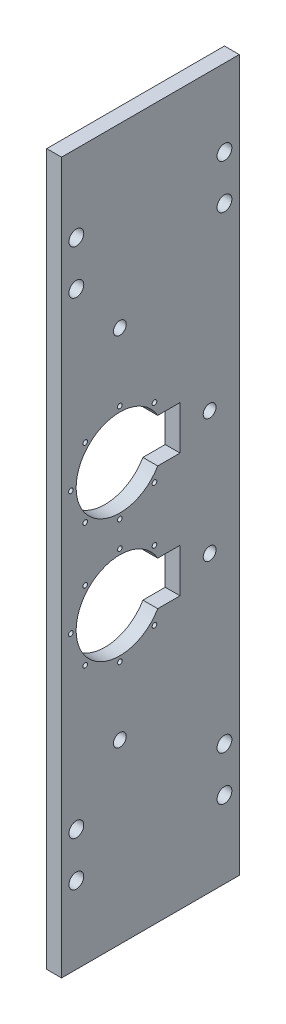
ISO-10303-21;
HEADER;
FILE_DESCRIPTION(('STEP AP214'),'2;1');
FILE_NAME('part.step','',(''),(''),'','','');
FILE_SCHEMA(('AUTOMOTIVE_DESIGN { 1 0 10303 214 1 1 1 1 }'));
ENDSEC;
DATA;
#1=APPLICATION_CONTEXT('core data for automotive mechanical design processes');
#2=APPLICATION_PROTOCOL_DEFINITION('international standard','automotive_design',2000,#1);
#3=PRODUCT_CONTEXT('',#1,'mechanical');
#4=PRODUCT('Part','Part','',(#3));
#5=PRODUCT_RELATED_PRODUCT_CATEGORY('part','',(#4));
#6=PRODUCT_DEFINITION_FORMATION('','',#4);
#7=PRODUCT_DEFINITION_CONTEXT('part definition',#1,'design');
#8=PRODUCT_DEFINITION('design','',#6,#7);
#9=PRODUCT_DEFINITION_SHAPE('','',#8);
#10=(LENGTH_UNIT() NAMED_UNIT(*) SI_UNIT(.MILLI.,.METRE.));
#11=(NAMED_UNIT(*) PLANE_ANGLE_UNIT() SI_UNIT($,.RADIAN.));
#12=(NAMED_UNIT(*) SI_UNIT($,.STERADIAN.) SOLID_ANGLE_UNIT());
#13=UNCERTAINTY_MEASURE_WITH_UNIT(LENGTH_MEASURE(1.E-05),#10,'distance_accuracy_value','');
#14=(GEOMETRIC_REPRESENTATION_CONTEXT(3) GLOBAL_UNCERTAINTY_ASSIGNED_CONTEXT((#13)) GLOBAL_UNIT_ASSIGNED_CONTEXT((#10,
#11,#12)) REPRESENTATION_CONTEXT('',''));
#15=CARTESIAN_POINT('',(0.,0.,0.));
#16=DIRECTION('',(0.,0.,1.));
#17=DIRECTION('',(1.,0.,0.));
#18=AXIS2_PLACEMENT_3D('',#15,#16,#17);
#19=CARTESIAN_POINT('',(6.35,0.,0.));
#20=DIRECTION('',(1.,0.,0.));
#21=DIRECTION('',(0.,0.,-1.));
#22=AXIS2_PLACEMENT_3D('',#19,#20,#21);
#23=PLANE('',#22);
#24=CARTESIAN_POINT('',(6.35,53.,-50.8));
#25=DIRECTION('',(1.,0.,0.));
#26=DIRECTION('',(0.,0.,-1.));
#27=AXIS2_PLACEMENT_3D('',#24,#25,#26);
#28=CIRCLE('',#27,5.49999999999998);
#29=CARTESIAN_POINT('',(6.35,53.,-56.3));
#30=VERTEX_POINT('',#29);
#31=EDGE_CURVE('E805',#30,#30,#28,.T.);
#32=ORIENTED_EDGE('',*,*,#31,.F.);
#33=EDGE_LOOP('',(#32));
#34=FACE_BOUND('',#33,.T.);
#35=CARTESIAN_POINT('',(6.35,153.,26.2));
#36=DIRECTION('',(1.,0.,0.));
#37=DIRECTION('',(0.,0.,-1.));
#38=AXIS2_PLACEMENT_3D('',#35,#36,#37);
#39=CIRCLE('',#38,5.49999999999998);
#40=CARTESIAN_POINT('',(6.35,153.,20.7));
#41=VERTEX_POINT('',#40);
#42=EDGE_CURVE('E807',#41,#41,#39,.T.);
#43=ORIENTED_EDGE('',*,*,#42,.F.);
#44=EDGE_LOOP('',(#43));
#45=FACE_BOUND('',#44,.T.);
#46=CARTESIAN_POINT('',(6.35,-53.,-50.8));
#47=DIRECTION('',(1.,0.,0.));
#48=DIRECTION('',(0.,0.,-1.));
#49=AXIS2_PLACEMENT_3D('',#46,#47,#48);
#50=CIRCLE('',#49,5.49999999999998);
#51=CARTESIAN_POINT('',(6.35,-53.,-56.3));
#52=VERTEX_POINT('',#51);
#53=EDGE_CURVE('E815',#52,#52,#50,.T.);
#54=ORIENTED_EDGE('',*,*,#53,.F.);
#55=EDGE_LOOP('',(#54));
#56=FACE_BOUND('',#55,.T.);
#57=CARTESIAN_POINT('',(6.35,-153.,26.2));
#58=DIRECTION('',(1.,0.,0.));
#59=DIRECTION('',(0.,0.,-1.));
#60=AXIS2_PLACEMENT_3D('',#57,#58,#59);
#61=CIRCLE('',#60,5.49999999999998);
#62=CARTESIAN_POINT('',(6.35,-153.,20.7));
#63=VERTEX_POINT('',#62);
#64=EDGE_CURVE('E821',#63,#63,#61,.T.);
#65=ORIENTED_EDGE('',*,*,#64,.F.);
#66=EDGE_LOOP('',(#65));
#67=FACE_BOUND('',#66,.T.);
#68=CARTESIAN_POINT('',(6.35,-11.0000000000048,26.1999999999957));
#69=DIRECTION('',(1.,0.,0.));
#70=DIRECTION('',(0.,0.,1.));
#71=AXIS2_PLACEMENT_3D('',#68,#69,#70);
#72=CIRCLE('',#71,2.00000000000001);
#73=CARTESIAN_POINT('',(6.35,-11.0000000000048,28.1999999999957));
#74=VERTEX_POINT('',#73);
#75=EDGE_CURVE('E174',#74,#74,#72,.T.);
#76=ORIENTED_EDGE('',*,*,#75,.F.);
#77=EDGE_LOOP('',(#76));
#78=FACE_BOUND('',#77,.T.);
#79=CARTESIAN_POINT('',(6.35,-53.,68.2));
#80=DIRECTION('',(1.,0.,0.));
#81=DIRECTION('',(0.,0.,1.));
#82=AXIS2_PLACEMENT_3D('',#79,#80,#81);
#83=CIRCLE('',#82,2.);
#84=CARTESIAN_POINT('',(6.35,-53.,70.2));
#85=VERTEX_POINT('',#84);
#86=EDGE_CURVE('E186',#85,#85,#83,.T.);
#87=ORIENTED_EDGE('',*,*,#86,.F.);
#88=EDGE_LOOP('',(#87));
#89=FACE_BOUND('',#88,.T.);
#90=CARTESIAN_POINT('',(6.35,-95.0000000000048,26.2000000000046));
#91=DIRECTION('',(1.,0.,0.));
#92=DIRECTION('',(0.,0.,1.));
#93=AXIS2_PLACEMENT_3D('',#90,#91,#92);
#94=CIRCLE('',#93,2.00000000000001);
#95=CARTESIAN_POINT('',(6.35,-95.0000000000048,28.2000000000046));
#96=VERTEX_POINT('',#95);
#97=EDGE_CURVE('E198',#96,#96,#94,.T.);
#98=ORIENTED_EDGE('',*,*,#97,.F.);
#99=EDGE_LOOP('',(#98));
#100=FACE_BOUND('',#99,.T.);
#101=CARTESIAN_POINT('',(6.35,-200.66,-63.5));
#102=DIRECTION('',(1.,0.,0.));
#103=DIRECTION('',(0.,0.,-1.));
#104=AXIS2_PLACEMENT_3D('',#101,#102,#103);
#105=CIRCLE('',#104,6.34999999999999);
#106=CARTESIAN_POINT('',(6.35,-200.66,-69.85));
#107=VERTEX_POINT('',#106);
#108=EDGE_CURVE('E210',#107,#107,#105,.T.);
#109=ORIENTED_EDGE('',*,*,#108,.F.);
#110=EDGE_LOOP('',(#109));
#111=FACE_BOUND('',#110,.T.);
#112=CARTESIAN_POINT('',(6.35,-238.76,63.5));
#113=DIRECTION('',(1.,0.,0.));
#114=DIRECTION('',(0.,0.,1.));
#115=AXIS2_PLACEMENT_3D('',#112,#113,#114);
#116=CIRCLE('',#115,6.34999999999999);
#117=CARTESIAN_POINT('',(6.35,-238.76,69.85));
#118=VERTEX_POINT('',#117);
#119=EDGE_CURVE('E222',#118,#118,#116,.T.);
#120=ORIENTED_EDGE('',*,*,#119,.F.);
#121=EDGE_LOOP('',(#120));
#122=FACE_BOUND('',#121,.T.);
#123=CARTESIAN_POINT('',(6.35,238.76,-63.5));
#124=DIRECTION('',(1.,0.,0.));
#125=DIRECTION('',(0.,0.,1.));
#126=AXIS2_PLACEMENT_3D('',#123,#124,#125);
#127=CIRCLE('',#126,6.34999999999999);
#128=CARTESIAN_POINT('',(6.35,238.76,-57.15));
#129=VERTEX_POINT('',#128);
#130=EDGE_CURVE('E234',#129,#129,#127,.T.);
#131=ORIENTED_EDGE('',*,*,#130,.F.);
#132=EDGE_LOOP('',(#131));
#133=FACE_BOUND('',#132,.T.);
#134=CARTESIAN_POINT('',(6.35,200.66,63.5));
#135=DIRECTION('',(1.,0.,0.));
#136=DIRECTION('',(0.,0.,-1.));
#137=AXIS2_PLACEMENT_3D('',#134,#135,#136);
#138=CIRCLE('',#137,6.34999999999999);
#139=CARTESIAN_POINT('',(6.35,200.66,57.15));
#140=VERTEX_POINT('',#139);
#141=EDGE_CURVE('E246',#140,#140,#138,.T.);
#142=ORIENTED_EDGE('',*,*,#141,.F.);
#143=EDGE_LOOP('',(#142));
#144=FACE_BOUND('',#143,.T.);
#145=CARTESIAN_POINT('',(6.35,11.0000000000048,26.1999999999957));
#146=DIRECTION('',(1.,0.,0.));
#147=DIRECTION('',(0.,0.,-1.));
#148=AXIS2_PLACEMENT_3D('',#145,#146,#147);
#149=CIRCLE('',#148,2.00000000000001);
#150=CARTESIAN_POINT('',(6.35,11.0000000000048,24.1999999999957));
#151=VERTEX_POINT('',#150);
#152=EDGE_CURVE('E258',#151,#151,#149,.T.);
#153=ORIENTED_EDGE('',*,*,#152,.F.);
#154=EDGE_LOOP('',(#153));
#155=FACE_BOUND('',#154,.T.);
#156=CARTESIAN_POINT('',(6.35,82.698484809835,-3.498484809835));
#157=DIRECTION('',(1.,0.,0.));
#158=DIRECTION('',(0.,0.,-1.));
#159=AXIS2_PLACEMENT_3D('',#156,#157,#158);
#160=CIRCLE('',#159,1.99999999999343);
#161=CARTESIAN_POINT('',(6.35,82.698484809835,-5.49848480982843));
#162=VERTEX_POINT('',#161);
#163=EDGE_CURVE('E270',#162,#162,#160,.T.);
#164=ORIENTED_EDGE('',*,*,#163,.F.);
#165=EDGE_LOOP('',(#164));
#166=FACE_BOUND('',#165,.T.);
#167=CARTESIAN_POINT('',(6.35,82.6984848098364,55.8984848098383));
#168=DIRECTION('',(1.,0.,0.));
#169=DIRECTION('',(0.,0.,-1.));
#170=AXIS2_PLACEMENT_3D('',#167,#168,#169);
#171=CIRCLE('',#170,2.00000000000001);
#172=CARTESIAN_POINT('',(6.35,82.6984848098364,53.8984848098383));
#173=VERTEX_POINT('',#172);
#174=EDGE_CURVE('E282',#173,#173,#171,.T.);
#175=ORIENTED_EDGE('',*,*,#174,.F.);
#176=EDGE_LOOP('',(#175));
#177=FACE_BOUND('',#176,.T.);
#178=CARTESIAN_POINT('',(6.35,53.,68.2));
#179=DIRECTION('',(1.,0.,0.));
#180=DIRECTION('',(0.,0.,-1.));
#181=AXIS2_PLACEMENT_3D('',#178,#179,#180);
#182=CIRCLE('',#181,2.);
#183=CARTESIAN_POINT('',(6.35,53.,66.2));
#184=VERTEX_POINT('',#183);
#185=EDGE_CURVE('E294',#184,#184,#182,.T.);
#186=ORIENTED_EDGE('',*,*,#185,.F.);
#187=EDGE_LOOP('',(#186));
#188=FACE_BOUND('',#187,.T.);
#189=DIRECTION('',(0.,0.,1.));
#190=VECTOR('',#189,1.);
#191=CARTESIAN_POINT('',(6.35,304.8,76.2));
#192=LINE('',#191,#190);
#193=CARTESIAN_POINT('',(6.35,304.8,-76.2));
#194=VERTEX_POINT('',#193);
#195=CARTESIAN_POINT('',(6.35,304.8,76.2));
#196=VERTEX_POINT('',#195);
#197=EDGE_CURVE('E331',#194,#196,#192,.T.);
#198=ORIENTED_EDGE('',*,*,#197,.T.);
#199=DIRECTION('',(0.,-1.,0.));
#200=VECTOR('',#199,1.);
#201=CARTESIAN_POINT('',(6.35,-304.8,76.2));
#202=LINE('',#201,#200);
#203=CARTESIAN_POINT('',(6.35,-304.8,76.2));
#204=VERTEX_POINT('',#203);
#205=EDGE_CURVE('E334',#196,#204,#202,.T.);
#206=ORIENTED_EDGE('',*,*,#205,.T.);
#207=DIRECTION('',(0.,0.,-1.));
#208=VECTOR('',#207,1.);
#209=CARTESIAN_POINT('',(6.35,-304.8,76.2));
#210=LINE('',#209,#208);
#211=CARTESIAN_POINT('',(6.35,-304.8,-76.2));
#212=VERTEX_POINT('',#211);
#213=EDGE_CURVE('E337',#204,#212,#210,.T.);
#214=ORIENTED_EDGE('',*,*,#213,.T.);
#215=DIRECTION('',(0.,1.,0.));
#216=VECTOR('',#215,1.);
#217=CARTESIAN_POINT('',(6.35,-304.8,-76.2));
#218=LINE('',#217,#216);
#219=EDGE_CURVE('E339',#212,#194,#218,.T.);
#220=ORIENTED_EDGE('',*,*,#219,.T.);
#221=EDGE_LOOP('',(#198,#206,#214,#220));
#222=FACE_BOUND('',#221,.T.);
#223=DIRECTION('',(0.,0.,-1.));
#224=VECTOR('',#223,1.);
#225=CARTESIAN_POINT('',(6.35,34.25,-6.27595264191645));
#226=LINE('',#225,#224);
#227=CARTESIAN_POINT('',(6.35,34.25,-6.27595264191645));
#228=VERTEX_POINT('',#227);
#229=CARTESIAN_POINT('',(6.35,34.25,-25.4));
#230=VERTEX_POINT('',#229);
#231=EDGE_CURVE('E302',#228,#230,#226,.T.);
#232=ORIENTED_EDGE('',*,*,#231,.F.);
#233=CARTESIAN_POINT('',(6.35,53.,26.2));
#234=DIRECTION('',(1.,0.,0.));
#235=DIRECTION('',(0.,0.,-1.));
#236=AXIS2_PLACEMENT_3D('',#233,#234,#235);
#237=CIRCLE('',#236,37.5);
#238=CARTESIAN_POINT('',(6.35,71.7500000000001,-6.27595264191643));
#239=VERTEX_POINT('',#238);
#240=EDGE_CURVE('E300',#239,#228,#237,.T.);
#241=ORIENTED_EDGE('',*,*,#240,.F.);
#242=DIRECTION('',(0.,0.,1.));
#243=VECTOR('',#242,1.);
#244=CARTESIAN_POINT('',(6.35,71.7500000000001,-25.4));
#245=LINE('',#244,#243);
#246=CARTESIAN_POINT('',(6.35,71.7500000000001,-25.4));
#247=VERTEX_POINT('',#246);
#248=EDGE_CURVE('E308',#247,#239,#245,.T.);
#249=ORIENTED_EDGE('',*,*,#248,.F.);
#250=DIRECTION('',(0.,1.,0.));
#251=VECTOR('',#250,1.);
#252=CARTESIAN_POINT('',(6.35,34.25,-25.4));
#253=LINE('',#252,#251);
#254=EDGE_CURVE('E305',#230,#247,#253,.T.);
#255=ORIENTED_EDGE('',*,*,#254,.F.);
#256=EDGE_LOOP('',(#232,#241,#249,#255));
#257=FACE_BOUND('',#256,.T.);
#258=CARTESIAN_POINT('',(6.35,238.76,63.5));
#259=DIRECTION('',(1.,0.,0.));
#260=DIRECTION('',(0.,0.,-1.));
#261=AXIS2_PLACEMENT_3D('',#258,#259,#260);
#262=CIRCLE('',#261,6.34999999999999);
#263=CARTESIAN_POINT('',(6.35,238.76,57.15));
#264=VERTEX_POINT('',#263);
#265=EDGE_CURVE('E288',#264,#264,#262,.T.);
#266=ORIENTED_EDGE('',*,*,#265,.F.);
#267=EDGE_LOOP('',(#266));
#268=FACE_BOUND('',#267,.T.);
#269=CARTESIAN_POINT('',(6.35,95.0000000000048,26.2000000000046));
#270=DIRECTION('',(1.,0.,0.));
#271=DIRECTION('',(0.,0.,-1.));
#272=AXIS2_PLACEMENT_3D('',#269,#270,#271);
#273=CIRCLE('',#272,2.00000000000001);
#274=CARTESIAN_POINT('',(6.35,95.0000000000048,24.2000000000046));
#275=VERTEX_POINT('',#274);
#276=EDGE_CURVE('E276',#275,#275,#273,.T.);
#277=ORIENTED_EDGE('',*,*,#276,.F.);
#278=EDGE_LOOP('',(#277));
#279=FACE_BOUND('',#278,.T.);
#280=CARTESIAN_POINT('',(6.35,23.301515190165,-3.49848480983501));
#281=DIRECTION('',(1.,0.,0.));
#282=DIRECTION('',(0.,0.,-1.));
#283=AXIS2_PLACEMENT_3D('',#280,#281,#282);
#284=CIRCLE('',#283,1.99999999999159);
#285=CARTESIAN_POINT('',(6.35,23.301515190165,-5.4984848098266));
#286=VERTEX_POINT('',#285);
#287=EDGE_CURVE('E264',#286,#286,#284,.T.);
#288=ORIENTED_EDGE('',*,*,#287,.F.);
#289=EDGE_LOOP('',(#288));
#290=FACE_BOUND('',#289,.T.);
#291=CARTESIAN_POINT('',(6.35,23.3015151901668,55.898484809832));
#292=DIRECTION('',(1.,0.,0.));
#293=DIRECTION('',(0.,0.,-1.));
#294=AXIS2_PLACEMENT_3D('',#291,#292,#293);
#295=CIRCLE('',#294,2.00000000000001);
#296=CARTESIAN_POINT('',(6.35,23.3015151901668,53.898484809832));
#297=VERTEX_POINT('',#296);
#298=EDGE_CURVE('E252',#297,#297,#295,.T.);
#299=ORIENTED_EDGE('',*,*,#298,.F.);
#300=EDGE_LOOP('',(#299));
#301=FACE_BOUND('',#300,.T.);
#302=CARTESIAN_POINT('',(6.35,200.66,-63.5));
#303=DIRECTION('',(1.,0.,0.));
#304=DIRECTION('',(0.,0.,1.));
#305=AXIS2_PLACEMENT_3D('',#302,#303,#304);
#306=CIRCLE('',#305,6.34999999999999);
#307=CARTESIAN_POINT('',(6.35,200.66,-57.15));
#308=VERTEX_POINT('',#307);
#309=EDGE_CURVE('E240',#308,#308,#306,.T.);
#310=ORIENTED_EDGE('',*,*,#309,.F.);
#311=EDGE_LOOP('',(#310));
#312=FACE_BOUND('',#311,.T.);
#313=CARTESIAN_POINT('',(6.35,-200.66,63.5));
#314=DIRECTION('',(1.,0.,0.));
#315=DIRECTION('',(0.,0.,1.));
#316=AXIS2_PLACEMENT_3D('',#313,#314,#315);
#317=CIRCLE('',#316,6.34999999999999);
#318=CARTESIAN_POINT('',(6.35,-200.66,69.85));
#319=VERTEX_POINT('',#318);
#320=EDGE_CURVE('E228',#319,#319,#317,.T.);
#321=ORIENTED_EDGE('',*,*,#320,.F.);
#322=EDGE_LOOP('',(#321));
#323=FACE_BOUND('',#322,.T.);
#324=CARTESIAN_POINT('',(6.35,-238.76,-63.5));
#325=DIRECTION('',(1.,0.,0.));
#326=DIRECTION('',(0.,0.,-1.));
#327=AXIS2_PLACEMENT_3D('',#324,#325,#326);
#328=CIRCLE('',#327,6.34999999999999);
#329=CARTESIAN_POINT('',(6.35,-238.76,-69.85));
#330=VERTEX_POINT('',#329);
#331=EDGE_CURVE('E216',#330,#330,#328,.T.);
#332=ORIENTED_EDGE('',*,*,#331,.F.);
#333=EDGE_LOOP('',(#332));
#334=FACE_BOUND('',#333,.T.);
#335=CARTESIAN_POINT('',(6.35,-82.698484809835,-3.498484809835));
#336=DIRECTION('',(1.,0.,0.));
#337=DIRECTION('',(0.,0.,1.));
#338=AXIS2_PLACEMENT_3D('',#335,#336,#337);
#339=CIRCLE('',#338,1.99999999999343);
#340=CARTESIAN_POINT('',(6.35,-82.698484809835,-1.49848480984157));
#341=VERTEX_POINT('',#340);
#342=EDGE_CURVE('E204',#341,#341,#339,.T.);
#343=ORIENTED_EDGE('',*,*,#342,.F.);
#344=EDGE_LOOP('',(#343));
#345=FACE_BOUND('',#344,.T.);
#346=CARTESIAN_POINT('',(6.35,-82.6984848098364,55.8984848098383));
#347=DIRECTION('',(1.,0.,0.));
#348=DIRECTION('',(0.,0.,1.));
#349=AXIS2_PLACEMENT_3D('',#346,#347,#348);
#350=CIRCLE('',#349,2.00000000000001);
#351=CARTESIAN_POINT('',(6.35,-82.6984848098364,57.8984848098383));
#352=VERTEX_POINT('',#351);
#353=EDGE_CURVE('E192',#352,#352,#350,.T.);
#354=ORIENTED_EDGE('',*,*,#353,.F.);
#355=EDGE_LOOP('',(#354));
#356=FACE_BOUND('',#355,.T.);
#357=CARTESIAN_POINT('',(6.35,-23.3015151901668,55.898484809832));
#358=DIRECTION('',(1.,0.,0.));
#359=DIRECTION('',(0.,0.,1.));
#360=AXIS2_PLACEMENT_3D('',#357,#358,#359);
#361=CIRCLE('',#360,2.00000000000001);
#362=CARTESIAN_POINT('',(6.35,-23.3015151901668,57.898484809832));
#363=VERTEX_POINT('',#362);
#364=EDGE_CURVE('E180',#363,#363,#361,.T.);
#365=ORIENTED_EDGE('',*,*,#364,.F.);
#366=EDGE_LOOP('',(#365));
#367=FACE_BOUND('',#366,.T.);
#368=CARTESIAN_POINT('',(6.35,-23.301515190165,-3.49848480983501));
#369=DIRECTION('',(1.,0.,0.));
#370=DIRECTION('',(0.,0.,1.));
#371=AXIS2_PLACEMENT_3D('',#368,#369,#370);
#372=CIRCLE('',#371,1.99999999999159);
#373=CARTESIAN_POINT('',(6.35,-23.301515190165,-1.49848480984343));
#374=VERTEX_POINT('',#373);
#375=EDGE_CURVE('E168',#374,#374,#372,.T.);
#376=ORIENTED_EDGE('',*,*,#375,.F.);
#377=EDGE_LOOP('',(#376));
#378=FACE_BOUND('',#377,.T.);
#379=CARTESIAN_POINT('',(6.35,-53.,26.2));
#380=DIRECTION('',(1.,0.,0.));
#381=DIRECTION('',(0.,0.,1.));
#382=AXIS2_PLACEMENT_3D('',#379,#380,#381);
#383=CIRCLE('',#382,37.5);
#384=CARTESIAN_POINT('',(6.35,-34.25,-6.27595264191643));
#385=VERTEX_POINT('',#384);
#386=CARTESIAN_POINT('',(6.35,-71.7500000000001,-6.27595264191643));
#387=VERTEX_POINT('',#386);
#388=EDGE_CURVE('E138',#385,#387,#383,.T.);
#389=ORIENTED_EDGE('',*,*,#388,.F.);
#390=DIRECTION('',(0.,0.,1.));
#391=VECTOR('',#390,1.);
#392=CARTESIAN_POINT('',(6.35,-34.25,-6.27595264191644));
#393=LINE('',#392,#391);
#394=CARTESIAN_POINT('',(6.35,-34.25,-25.4));
#395=VERTEX_POINT('',#394);
#396=EDGE_CURVE('E130',#395,#385,#393,.T.);
#397=ORIENTED_EDGE('',*,*,#396,.F.);
#398=DIRECTION('',(0.,1.,0.));
#399=VECTOR('',#398,1.);
#400=CARTESIAN_POINT('',(6.35,-34.25,-25.4));
#401=LINE('',#400,#399);
#402=CARTESIAN_POINT('',(6.35,-71.7500000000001,-25.4));
#403=VERTEX_POINT('',#402);
#404=EDGE_CURVE('E152',#403,#395,#401,.T.);
#405=ORIENTED_EDGE('',*,*,#404,.F.);
#406=DIRECTION('',(0.,0.,-1.));
#407=VECTOR('',#406,1.);
#408=CARTESIAN_POINT('',(6.35,-71.7500000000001,-25.4));
#409=LINE('',#408,#407);
#410=EDGE_CURVE('E150',#387,#403,#409,.T.);
#411=ORIENTED_EDGE('',*,*,#410,.F.);
#412=EDGE_LOOP('',(#389,#397,#405,#411));
#413=FACE_BOUND('',#412,.T.);
#414=ADVANCED_FACE('F41',(#34,#45,#56,#67,#78,#89,#100,#111,#122,#133,#144,#155,#166,#177,#188,
#222,#257,#268,#279,#290,#301,#312,#323,#334,#345,#356,#367,#378,#413),#23,.T.);
#415=CARTESIAN_POINT('',(-6.35,0.,0.));
#416=DIRECTION('',(1.,0.,0.));
#417=DIRECTION('',(0.,0.,-1.));
#418=AXIS2_PLACEMENT_3D('',#415,#416,#417);
#419=PLANE('',#418);
#420=CARTESIAN_POINT('',(-6.35,53.,-50.8));
#421=DIRECTION('',(1.,0.,0.));
#422=DIRECTION('',(0.,0.,-1.));
#423=AXIS2_PLACEMENT_3D('',#420,#421,#422);
#424=CIRCLE('',#423,5.5);
#425=CARTESIAN_POINT('',(-6.35,53.,-56.3));
#426=VERTEX_POINT('',#425);
#427=EDGE_CURVE('E803',#426,#426,#424,.T.);
#428=ORIENTED_EDGE('',*,*,#427,.T.);
#429=EDGE_LOOP('',(#428));
#430=FACE_BOUND('',#429,.T.);
#431=CARTESIAN_POINT('',(-6.35,153.,26.2));
#432=DIRECTION('',(1.,0.,0.));
#433=DIRECTION('',(0.,0.,-1.));
#434=AXIS2_PLACEMENT_3D('',#431,#432,#433);
#435=CIRCLE('',#434,5.50000000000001);
#436=CARTESIAN_POINT('',(-6.35,153.,20.7));
#437=VERTEX_POINT('',#436);
#438=EDGE_CURVE('E812',#437,#437,#435,.T.);
#439=ORIENTED_EDGE('',*,*,#438,.T.);
#440=EDGE_LOOP('',(#439));
#441=FACE_BOUND('',#440,.T.);
#442=CARTESIAN_POINT('',(-6.35,-53.,-50.8));
#443=DIRECTION('',(1.,0.,0.));
#444=DIRECTION('',(0.,0.,-1.));
#445=AXIS2_PLACEMENT_3D('',#442,#443,#444);
#446=CIRCLE('',#445,5.5);
#447=CARTESIAN_POINT('',(-6.35,-53.,-56.3));
#448=VERTEX_POINT('',#447);
#449=EDGE_CURVE('E818',#448,#448,#446,.T.);
#450=ORIENTED_EDGE('',*,*,#449,.T.);
#451=EDGE_LOOP('',(#450));
#452=FACE_BOUND('',#451,.T.);
#453=CARTESIAN_POINT('',(-6.35,-153.,26.2));
#454=DIRECTION('',(1.,0.,0.));
#455=DIRECTION('',(0.,0.,-1.));
#456=AXIS2_PLACEMENT_3D('',#453,#454,#455);
#457=CIRCLE('',#456,5.50000000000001);
#458=CARTESIAN_POINT('',(-6.35,-153.,20.7));
#459=VERTEX_POINT('',#458);
#460=EDGE_CURVE('E158',#459,#459,#457,.T.);
#461=ORIENTED_EDGE('',*,*,#460,.T.);
#462=EDGE_LOOP('',(#461));
#463=FACE_BOUND('',#462,.T.);
#464=CARTESIAN_POINT('',(-6.35,-23.301515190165,-3.49848480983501));
#465=DIRECTION('',(1.,0.,0.));
#466=DIRECTION('',(0.,0.,1.));
#467=AXIS2_PLACEMENT_3D('',#464,#465,#466);
#468=CIRCLE('',#467,1.99999999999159);
#469=CARTESIAN_POINT('',(-6.35,-23.301515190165,-1.49848480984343));
#470=VERTEX_POINT('',#469);
#471=EDGE_CURVE('E146',#470,#470,#468,.T.);
#472=ORIENTED_EDGE('',*,*,#471,.T.);
#473=EDGE_LOOP('',(#472));
#474=FACE_BOUND('',#473,.T.);
#475=CARTESIAN_POINT('',(-6.35,-11.0000000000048,26.1999999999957));
#476=DIRECTION('',(1.,0.,0.));
#477=DIRECTION('',(0.,0.,1.));
#478=AXIS2_PLACEMENT_3D('',#475,#476,#477);
#479=CIRCLE('',#478,2.00000000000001);
#480=CARTESIAN_POINT('',(-6.35,-11.0000000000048,28.1999999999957));
#481=VERTEX_POINT('',#480);
#482=EDGE_CURVE('E171',#481,#481,#479,.T.);
#483=ORIENTED_EDGE('',*,*,#482,.T.);
#484=EDGE_LOOP('',(#483));
#485=FACE_BOUND('',#484,.T.);
#486=CARTESIAN_POINT('',(-6.35,-23.3015151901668,55.898484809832));
#487=DIRECTION('',(1.,0.,0.));
#488=DIRECTION('',(0.,0.,1.));
#489=AXIS2_PLACEMENT_3D('',#486,#487,#488);
#490=CIRCLE('',#489,2.00000000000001);
#491=CARTESIAN_POINT('',(-6.35,-23.3015151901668,57.898484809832));
#492=VERTEX_POINT('',#491);
#493=EDGE_CURVE('E177',#492,#492,#490,.T.);
#494=ORIENTED_EDGE('',*,*,#493,.T.);
#495=EDGE_LOOP('',(#494));
#496=FACE_BOUND('',#495,.T.);
#497=CARTESIAN_POINT('',(-6.35,-53.,68.2));
#498=DIRECTION('',(1.,0.,0.));
#499=DIRECTION('',(0.,0.,1.));
#500=AXIS2_PLACEMENT_3D('',#497,#498,#499);
#501=CIRCLE('',#500,2.);
#502=CARTESIAN_POINT('',(-6.35,-53.,70.2));
#503=VERTEX_POINT('',#502);
#504=EDGE_CURVE('E183',#503,#503,#501,.T.);
#505=ORIENTED_EDGE('',*,*,#504,.T.);
#506=EDGE_LOOP('',(#505));
#507=FACE_BOUND('',#506,.T.);
#508=CARTESIAN_POINT('',(-6.35,-82.6984848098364,55.8984848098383));
#509=DIRECTION('',(1.,0.,0.));
#510=DIRECTION('',(0.,0.,1.));
#511=AXIS2_PLACEMENT_3D('',#508,#509,#510);
#512=CIRCLE('',#511,2.00000000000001);
#513=CARTESIAN_POINT('',(-6.35,-82.6984848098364,57.8984848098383));
#514=VERTEX_POINT('',#513);
#515=EDGE_CURVE('E189',#514,#514,#512,.T.);
#516=ORIENTED_EDGE('',*,*,#515,.T.);
#517=EDGE_LOOP('',(#516));
#518=FACE_BOUND('',#517,.T.);
#519=CARTESIAN_POINT('',(-6.35,-95.0000000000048,26.2000000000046));
#520=DIRECTION('',(1.,0.,0.));
#521=DIRECTION('',(0.,0.,1.));
#522=AXIS2_PLACEMENT_3D('',#519,#520,#521);
#523=CIRCLE('',#522,2.00000000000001);
#524=CARTESIAN_POINT('',(-6.35,-95.0000000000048,28.2000000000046));
#525=VERTEX_POINT('',#524);
#526=EDGE_CURVE('E195',#525,#525,#523,.T.);
#527=ORIENTED_EDGE('',*,*,#526,.T.);
#528=EDGE_LOOP('',(#527));
#529=FACE_BOUND('',#528,.T.);
#530=CARTESIAN_POINT('',(-6.35,-82.698484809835,-3.498484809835));
#531=DIRECTION('',(1.,0.,0.));
#532=DIRECTION('',(0.,0.,1.));
#533=AXIS2_PLACEMENT_3D('',#530,#531,#532);
#534=CIRCLE('',#533,1.99999999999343);
#535=CARTESIAN_POINT('',(-6.35,-82.698484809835,-1.49848480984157));
#536=VERTEX_POINT('',#535);
#537=EDGE_CURVE('E201',#536,#536,#534,.T.);
#538=ORIENTED_EDGE('',*,*,#537,.T.);
#539=EDGE_LOOP('',(#538));
#540=FACE_BOUND('',#539,.T.);
#541=CARTESIAN_POINT('',(-6.35,-200.66,-63.5));
#542=DIRECTION('',(1.,0.,0.));
#543=DIRECTION('',(0.,0.,-1.));
#544=AXIS2_PLACEMENT_3D('',#541,#542,#543);
#545=CIRCLE('',#544,6.34999999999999);
#546=CARTESIAN_POINT('',(-6.35,-200.66,-69.85));
#547=VERTEX_POINT('',#546);
#548=EDGE_CURVE('E207',#547,#547,#545,.T.);
#549=ORIENTED_EDGE('',*,*,#548,.T.);
#550=EDGE_LOOP('',(#549));
#551=FACE_BOUND('',#550,.T.);
#552=CARTESIAN_POINT('',(-6.35,-238.76,-63.5));
#553=DIRECTION('',(1.,0.,0.));
#554=DIRECTION('',(0.,0.,-1.));
#555=AXIS2_PLACEMENT_3D('',#552,#553,#554);
#556=CIRCLE('',#555,6.34999999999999);
#557=CARTESIAN_POINT('',(-6.35,-238.76,-69.85));
#558=VERTEX_POINT('',#557);
#559=EDGE_CURVE('E213',#558,#558,#556,.T.);
#560=ORIENTED_EDGE('',*,*,#559,.T.);
#561=EDGE_LOOP('',(#560));
#562=FACE_BOUND('',#561,.T.);
#563=CARTESIAN_POINT('',(-6.35,-238.76,63.5));
#564=DIRECTION('',(1.,0.,0.));
#565=DIRECTION('',(0.,0.,1.));
#566=AXIS2_PLACEMENT_3D('',#563,#564,#565);
#567=CIRCLE('',#566,6.34999999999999);
#568=CARTESIAN_POINT('',(-6.35,-238.76,69.85));
#569=VERTEX_POINT('',#568);
#570=EDGE_CURVE('E219',#569,#569,#567,.T.);
#571=ORIENTED_EDGE('',*,*,#570,.T.);
#572=EDGE_LOOP('',(#571));
#573=FACE_BOUND('',#572,.T.);
#574=CARTESIAN_POINT('',(-6.35,-200.66,63.5));
#575=DIRECTION('',(1.,0.,0.));
#576=DIRECTION('',(0.,0.,1.));
#577=AXIS2_PLACEMENT_3D('',#574,#575,#576);
#578=CIRCLE('',#577,6.34999999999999);
#579=CARTESIAN_POINT('',(-6.35,-200.66,69.85));
#580=VERTEX_POINT('',#579);
#581=EDGE_CURVE('E225',#580,#580,#578,.T.);
#582=ORIENTED_EDGE('',*,*,#581,.T.);
#583=EDGE_LOOP('',(#582));
#584=FACE_BOUND('',#583,.T.);
#585=CARTESIAN_POINT('',(-6.35,238.76,-63.5));
#586=DIRECTION('',(1.,0.,0.));
#587=DIRECTION('',(0.,0.,1.));
#588=AXIS2_PLACEMENT_3D('',#585,#586,#587);
#589=CIRCLE('',#588,6.34999999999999);
#590=CARTESIAN_POINT('',(-6.35,238.76,-57.15));
#591=VERTEX_POINT('',#590);
#592=EDGE_CURVE('E231',#591,#591,#589,.T.);
#593=ORIENTED_EDGE('',*,*,#592,.T.);
#594=EDGE_LOOP('',(#593));
#595=FACE_BOUND('',#594,.T.);
#596=CARTESIAN_POINT('',(-6.35,200.66,-63.5));
#597=DIRECTION('',(1.,0.,0.));
#598=DIRECTION('',(0.,0.,1.));
#599=AXIS2_PLACEMENT_3D('',#596,#597,#598);
#600=CIRCLE('',#599,6.34999999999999);
#601=CARTESIAN_POINT('',(-6.35,200.66,-57.15));
#602=VERTEX_POINT('',#601);
#603=EDGE_CURVE('E237',#602,#602,#600,.T.);
#604=ORIENTED_EDGE('',*,*,#603,.T.);
#605=EDGE_LOOP('',(#604));
#606=FACE_BOUND('',#605,.T.);
#607=CARTESIAN_POINT('',(-6.35,200.66,63.5));
#608=DIRECTION('',(1.,0.,0.));
#609=DIRECTION('',(0.,0.,-1.));
#610=AXIS2_PLACEMENT_3D('',#607,#608,#609);
#611=CIRCLE('',#610,6.34999999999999);
#612=CARTESIAN_POINT('',(-6.35,200.66,57.15));
#613=VERTEX_POINT('',#612);
#614=EDGE_CURVE('E243',#613,#613,#611,.T.);
#615=ORIENTED_EDGE('',*,*,#614,.T.);
#616=EDGE_LOOP('',(#615));
#617=FACE_BOUND('',#616,.T.);
#618=CARTESIAN_POINT('',(-6.35,23.3015151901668,55.898484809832));
#619=DIRECTION('',(1.,0.,0.));
#620=DIRECTION('',(0.,0.,-1.));
#621=AXIS2_PLACEMENT_3D('',#618,#619,#620);
#622=CIRCLE('',#621,2.00000000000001);
#623=CARTESIAN_POINT('',(-6.35,23.3015151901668,53.898484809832));
#624=VERTEX_POINT('',#623);
#625=EDGE_CURVE('E249',#624,#624,#622,.T.);
#626=ORIENTED_EDGE('',*,*,#625,.T.);
#627=EDGE_LOOP('',(#626));
#628=FACE_BOUND('',#627,.T.);
#629=CARTESIAN_POINT('',(-6.35,11.0000000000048,26.1999999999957));
#630=DIRECTION('',(1.,0.,0.));
#631=DIRECTION('',(0.,0.,-1.));
#632=AXIS2_PLACEMENT_3D('',#629,#630,#631);
#633=CIRCLE('',#632,2.00000000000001);
#634=CARTESIAN_POINT('',(-6.35,11.0000000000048,24.1999999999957));
#635=VERTEX_POINT('',#634);
#636=EDGE_CURVE('E255',#635,#635,#633,.T.);
#637=ORIENTED_EDGE('',*,*,#636,.T.);
#638=EDGE_LOOP('',(#637));
#639=FACE_BOUND('',#638,.T.);
#640=CARTESIAN_POINT('',(-6.35,23.301515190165,-3.49848480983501));
#641=DIRECTION('',(1.,0.,0.));
#642=DIRECTION('',(0.,0.,-1.));
#643=AXIS2_PLACEMENT_3D('',#640,#641,#642);
#644=CIRCLE('',#643,1.99999999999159);
#645=CARTESIAN_POINT('',(-6.35,23.301515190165,-5.4984848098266));
#646=VERTEX_POINT('',#645);
#647=EDGE_CURVE('E261',#646,#646,#644,.T.);
#648=ORIENTED_EDGE('',*,*,#647,.T.);
#649=EDGE_LOOP('',(#648));
#650=FACE_BOUND('',#649,.T.);
#651=CARTESIAN_POINT('',(-6.35,82.698484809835,-3.498484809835));
#652=DIRECTION('',(1.,0.,0.));
#653=DIRECTION('',(0.,0.,-1.));
#654=AXIS2_PLACEMENT_3D('',#651,#652,#653);
#655=CIRCLE('',#654,1.99999999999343);
#656=CARTESIAN_POINT('',(-6.35,82.698484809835,-5.49848480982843));
#657=VERTEX_POINT('',#656);
#658=EDGE_CURVE('E267',#657,#657,#655,.T.);
#659=ORIENTED_EDGE('',*,*,#658,.T.);
#660=EDGE_LOOP('',(#659));
#661=FACE_BOUND('',#660,.T.);
#662=CARTESIAN_POINT('',(-6.35,95.0000000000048,26.2000000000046));
#663=DIRECTION('',(1.,0.,0.));
#664=DIRECTION('',(0.,0.,-1.));
#665=AXIS2_PLACEMENT_3D('',#662,#663,#664);
#666=CIRCLE('',#665,2.00000000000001);
#667=CARTESIAN_POINT('',(-6.35,95.0000000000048,24.2000000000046));
#668=VERTEX_POINT('',#667);
#669=EDGE_CURVE('E273',#668,#668,#666,.T.);
#670=ORIENTED_EDGE('',*,*,#669,.T.);
#671=EDGE_LOOP('',(#670));
#672=FACE_BOUND('',#671,.T.);
#673=CARTESIAN_POINT('',(-6.35,82.6984848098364,55.8984848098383));
#674=DIRECTION('',(1.,0.,0.));
#675=DIRECTION('',(0.,0.,-1.));
#676=AXIS2_PLACEMENT_3D('',#673,#674,#675);
#677=CIRCLE('',#676,2.00000000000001);
#678=CARTESIAN_POINT('',(-6.35,82.6984848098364,53.8984848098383));
#679=VERTEX_POINT('',#678);
#680=EDGE_CURVE('E279',#679,#679,#677,.T.);
#681=ORIENTED_EDGE('',*,*,#680,.T.);
#682=EDGE_LOOP('',(#681));
#683=FACE_BOUND('',#682,.T.);
#684=CARTESIAN_POINT('',(-6.35,238.76,63.5));
#685=DIRECTION('',(1.,0.,0.));
#686=DIRECTION('',(0.,0.,-1.));
#687=AXIS2_PLACEMENT_3D('',#684,#685,#686);
#688=CIRCLE('',#687,6.34999999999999);
#689=CARTESIAN_POINT('',(-6.35,238.76,57.15));
#690=VERTEX_POINT('',#689);
#691=EDGE_CURVE('E285',#690,#690,#688,.T.);
#692=ORIENTED_EDGE('',*,*,#691,.T.);
#693=EDGE_LOOP('',(#692));
#694=FACE_BOUND('',#693,.T.);
#695=CARTESIAN_POINT('',(-6.35,53.,68.2));
#696=DIRECTION('',(1.,0.,0.));
#697=DIRECTION('',(0.,0.,-1.));
#698=AXIS2_PLACEMENT_3D('',#695,#696,#697);
#699=CIRCLE('',#698,2.);
#700=CARTESIAN_POINT('',(-6.35,53.,66.2));
#701=VERTEX_POINT('',#700);
#702=EDGE_CURVE('E291',#701,#701,#699,.T.);
#703=ORIENTED_EDGE('',*,*,#702,.T.);
#704=EDGE_LOOP('',(#703));
#705=FACE_BOUND('',#704,.T.);
#706=CARTESIAN_POINT('',(-6.35,53.,26.2));
#707=DIRECTION('',(1.,0.,0.));
#708=DIRECTION('',(0.,0.,-1.));
#709=AXIS2_PLACEMENT_3D('',#706,#707,#708);
#710=CIRCLE('',#709,37.5);
#711=CARTESIAN_POINT('',(-6.35,71.7500000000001,-6.27595264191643));
#712=VERTEX_POINT('',#711);
#713=CARTESIAN_POINT('',(-6.35,34.25,-6.27595264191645));
#714=VERTEX_POINT('',#713);
#715=EDGE_CURVE('E297',#712,#714,#710,.T.);
#716=ORIENTED_EDGE('',*,*,#715,.T.);
#717=DIRECTION('',(0.,0.,-1.));
#718=VECTOR('',#717,1.);
#719=CARTESIAN_POINT('',(-6.35,34.25,-6.27595264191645));
#720=LINE('',#719,#718);
#721=CARTESIAN_POINT('',(-6.35,34.25,-25.4));
#722=VERTEX_POINT('',#721);
#723=EDGE_CURVE('E313',#714,#722,#720,.T.);
#724=ORIENTED_EDGE('',*,*,#723,.T.);
#725=DIRECTION('',(0.,1.,0.));
#726=VECTOR('',#725,1.);
#727=CARTESIAN_POINT('',(-6.35,34.25,-25.4));
#728=LINE('',#727,#726);
#729=CARTESIAN_POINT('',(-6.35,71.7500000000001,-25.4));
#730=VERTEX_POINT('',#729);
#731=EDGE_CURVE('E316',#722,#730,#728,.T.);
#732=ORIENTED_EDGE('',*,*,#731,.T.);
#733=DIRECTION('',(0.,0.,1.));
#734=VECTOR('',#733,1.);
#735=CARTESIAN_POINT('',(-6.35,71.7500000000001,-25.4));
#736=LINE('',#735,#734);
#737=EDGE_CURVE('E303',#730,#712,#736,.T.);
#738=ORIENTED_EDGE('',*,*,#737,.T.);
#739=EDGE_LOOP('',(#716,#724,#732,#738));
#740=FACE_BOUND('',#739,.T.);
#741=DIRECTION('',(0.,0.,1.));
#742=VECTOR('',#741,1.);
#743=CARTESIAN_POINT('',(-6.35,304.8,76.2));
#744=LINE('',#743,#742);
#745=CARTESIAN_POINT('',(-6.35,304.8,-76.2));
#746=VERTEX_POINT('',#745);
#747=CARTESIAN_POINT('',(-6.35,304.8,76.2));
#748=VERTEX_POINT('',#747);
#749=EDGE_CURVE('E330',#746,#748,#744,.T.);
#750=ORIENTED_EDGE('',*,*,#749,.F.);
#751=DIRECTION('',(0.,1.,0.));
#752=VECTOR('',#751,1.);
#753=CARTESIAN_POINT('',(-6.35,-304.8,-76.2));
#754=LINE('',#753,#752);
#755=CARTESIAN_POINT('',(-6.35,-304.8,-76.2));
#756=VERTEX_POINT('',#755);
#757=EDGE_CURVE('E335',#756,#746,#754,.T.);
#758=ORIENTED_EDGE('',*,*,#757,.F.);
#759=DIRECTION('',(0.,0.,-1.));
#760=VECTOR('',#759,1.);
#761=CARTESIAN_POINT('',(-6.35,-304.8,76.2));
#762=LINE('',#761,#760);
#763=CARTESIAN_POINT('',(-6.35,-304.8,76.2));
#764=VERTEX_POINT('',#763);
#765=EDGE_CURVE('E346',#764,#756,#762,.T.);
#766=ORIENTED_EDGE('',*,*,#765,.F.);
#767=DIRECTION('',(0.,-1.,0.));
#768=VECTOR('',#767,1.);
#769=CARTESIAN_POINT('',(-6.35,-304.8,76.2));
#770=LINE('',#769,#768);
#771=EDGE_CURVE('E344',#748,#764,#770,.T.);
#772=ORIENTED_EDGE('',*,*,#771,.F.);
#773=EDGE_LOOP('',(#750,#758,#766,#772));
#774=FACE_BOUND('',#773,.T.);
#775=DIRECTION('',(0.,0.,1.));
#776=VECTOR('',#775,1.);
#777=CARTESIAN_POINT('',(-6.35,-34.25,-6.27595264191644));
#778=LINE('',#777,#776);
#779=CARTESIAN_POINT('',(-6.35,-34.25,-25.4));
#780=VERTEX_POINT('',#779);
#781=CARTESIAN_POINT('',(-6.35,-34.25,-6.27595264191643));
#782=VERTEX_POINT('',#781);
#783=EDGE_CURVE('E64',#780,#782,#778,.T.);
#784=ORIENTED_EDGE('',*,*,#783,.T.);
#785=CARTESIAN_POINT('',(-6.35,-53.,26.2));
#786=DIRECTION('',(1.,0.,0.));
#787=DIRECTION('',(0.,0.,1.));
#788=AXIS2_PLACEMENT_3D('',#785,#786,#787);
#789=CIRCLE('',#788,37.5);
#790=CARTESIAN_POINT('',(-6.35,-71.7500000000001,-6.27595264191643));
#791=VERTEX_POINT('',#790);
#792=EDGE_CURVE('E145',#782,#791,#789,.T.);
#793=ORIENTED_EDGE('',*,*,#792,.T.);
#794=DIRECTION('',(0.,0.,-1.));
#795=VECTOR('',#794,1.);
#796=CARTESIAN_POINT('',(-6.35,-71.7500000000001,-25.4));
#797=LINE('',#796,#795);
#798=CARTESIAN_POINT('',(-6.35,-71.7500000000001,-25.4));
#799=VERTEX_POINT('',#798);
#800=EDGE_CURVE('E160',#791,#799,#797,.T.);
#801=ORIENTED_EDGE('',*,*,#800,.T.);
#802=DIRECTION('',(0.,1.,0.));
#803=VECTOR('',#802,1.);
#804=CARTESIAN_POINT('',(-6.35,-34.25,-25.4));
#805=LINE('',#804,#803);
#806=EDGE_CURVE('E139',#799,#780,#805,.T.);
#807=ORIENTED_EDGE('',*,*,#806,.T.);
#808=EDGE_LOOP('',(#784,#793,#801,#807));
#809=FACE_BOUND('',#808,.T.);
#810=ADVANCED_FACE('F364',(#430,#441,#452,#463,#474,#485,#496,#507,#518,#529,#540,#551,#562,
#573,#584,#595,#606,#617,#628,#639,#650,#661,#672,#683,#694,#705,#740,#774,#809),#419,.F.);
#811=CARTESIAN_POINT('',(6.35,304.8,76.2));
#812=DIRECTION('',(0.,-1.,0.));
#813=DIRECTION('',(0.,0.,-1.));
#814=AXIS2_PLACEMENT_3D('',#811,#812,#813);
#815=PLANE('',#814);
#816=ORIENTED_EDGE('',*,*,#749,.T.);
#817=DIRECTION('',(-1.,0.,0.));
#818=VECTOR('',#817,1.);
#819=CARTESIAN_POINT('',(6.35,304.8,76.2));
#820=LINE('',#819,#818);
#821=EDGE_CURVE('E11',#196,#748,#820,.T.);
#822=ORIENTED_EDGE('',*,*,#821,.F.);
#823=ORIENTED_EDGE('',*,*,#197,.F.);
#824=DIRECTION('',(-1.,0.,0.));
#825=VECTOR('',#824,1.);
#826=CARTESIAN_POINT('',(6.35,304.8,-76.2));
#827=LINE('',#826,#825);
#828=EDGE_CURVE('E341',#194,#746,#827,.T.);
#829=ORIENTED_EDGE('',*,*,#828,.T.);
#830=EDGE_LOOP('',(#816,#822,#823,#829));
#831=FACE_BOUND('',#830,.T.);
#832=ADVANCED_FACE('F43',(#831),#815,.F.);
#833=CARTESIAN_POINT('',(6.35,-304.8,76.2));
#834=DIRECTION('',(0.,0.,-1.));
#835=DIRECTION('',(-1.,0.,0.));
#836=AXIS2_PLACEMENT_3D('',#833,#834,#835);
#837=PLANE('',#836);
#838=ORIENTED_EDGE('',*,*,#771,.T.);
#839=DIRECTION('',(-1.,0.,0.));
#840=VECTOR('',#839,1.);
#841=CARTESIAN_POINT('',(6.35,-304.8,76.2));
#842=LINE('',#841,#840);
#843=EDGE_CURVE('E49',#204,#764,#842,.T.);
#844=ORIENTED_EDGE('',*,*,#843,.F.);
#845=ORIENTED_EDGE('',*,*,#205,.F.);
#846=ORIENTED_EDGE('',*,*,#821,.T.);
#847=EDGE_LOOP('',(#838,#844,#845,#846));
#848=FACE_BOUND('',#847,.T.);
#849=ADVANCED_FACE('F375',(#848),#837,.F.);
#850=CARTESIAN_POINT('',(6.35,-304.8,76.2));
#851=DIRECTION('',(0.,1.,0.));
#852=DIRECTION('',(0.,0.,1.));
#853=AXIS2_PLACEMENT_3D('',#850,#851,#852);
#854=PLANE('',#853);
#855=ORIENTED_EDGE('',*,*,#765,.T.);
#856=DIRECTION('',(-1.,0.,0.));
#857=VECTOR('',#856,1.);
#858=CARTESIAN_POINT('',(6.35,-304.8,-76.2));
#859=LINE('',#858,#857);
#860=EDGE_CURVE('E351',#212,#756,#859,.T.);
#861=ORIENTED_EDGE('',*,*,#860,.F.);
#862=ORIENTED_EDGE('',*,*,#213,.F.);
#863=ORIENTED_EDGE('',*,*,#843,.T.);
#864=EDGE_LOOP('',(#855,#861,#862,#863));
#865=FACE_BOUND('',#864,.T.);
#866=ADVANCED_FACE('F358',(#865),#854,.F.);
#867=CARTESIAN_POINT('',(6.35,-304.8,-76.2));
#868=DIRECTION('',(0.,0.,1.));
#869=DIRECTION('',(1.,0.,0.));
#870=AXIS2_PLACEMENT_3D('',#867,#868,#869);
#871=PLANE('',#870);
#872=ORIENTED_EDGE('',*,*,#757,.T.);
#873=ORIENTED_EDGE('',*,*,#828,.F.);
#874=ORIENTED_EDGE('',*,*,#219,.F.);
#875=ORIENTED_EDGE('',*,*,#860,.T.);
#876=EDGE_LOOP('',(#872,#873,#874,#875));
#877=FACE_BOUND('',#876,.T.);
#878=ADVANCED_FACE('F368',(#877),#871,.F.);
#879=CARTESIAN_POINT('',(6.35,53.,26.2));
#880=DIRECTION('',(-1.,0.,0.));
#881=DIRECTION('',(0.,0.,1.));
#882=AXIS2_PLACEMENT_3D('',#879,#880,#881);
#883=CYLINDRICAL_SURFACE('',#882,37.5);
#884=ORIENTED_EDGE('',*,*,#715,.F.);
#885=DIRECTION('',(-1.,0.,0.));
#886=VECTOR('',#885,1.);
#887=CARTESIAN_POINT('',(6.35,71.7500000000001,-6.27595264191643));
#888=LINE('',#887,#886);
#889=EDGE_CURVE('E310',#239,#712,#888,.T.);
#890=ORIENTED_EDGE('',*,*,#889,.F.);
#891=ORIENTED_EDGE('',*,*,#240,.T.);
#892=DIRECTION('',(-1.,0.,0.));
#893=VECTOR('',#892,1.);
#894=CARTESIAN_POINT('',(6.35,34.25,-6.27595264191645));
#895=LINE('',#894,#893);
#896=EDGE_CURVE('E327',#228,#714,#895,.T.);
#897=ORIENTED_EDGE('',*,*,#896,.T.);
#898=EDGE_LOOP('',(#884,#890,#891,#897));
#899=FACE_BOUND('',#898,.T.);
#900=ADVANCED_FACE('F394',(#899),#883,.F.);
#901=CARTESIAN_POINT('',(6.35,34.25,-6.27595264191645));
#902=DIRECTION('',(0.,1.,0.));
#903=DIRECTION('',(0.,0.,1.));
#904=AXIS2_PLACEMENT_3D('',#901,#902,#903);
#905=PLANE('',#904);
#906=ORIENTED_EDGE('',*,*,#723,.F.);
#907=ORIENTED_EDGE('',*,*,#896,.F.);
#908=ORIENTED_EDGE('',*,*,#231,.T.);
#909=DIRECTION('',(-1.,0.,0.));
#910=VECTOR('',#909,1.);
#911=CARTESIAN_POINT('',(6.35,34.25,-25.4));
#912=LINE('',#911,#910);
#913=EDGE_CURVE('E325',#230,#722,#912,.T.);
#914=ORIENTED_EDGE('',*,*,#913,.T.);
#915=EDGE_LOOP('',(#906,#907,#908,#914));
#916=FACE_BOUND('',#915,.T.);
#917=ADVANCED_FACE('F401',(#916),#905,.T.);
#918=CARTESIAN_POINT('',(6.35,34.25,-25.4));
#919=DIRECTION('',(0.,0.,1.));
#920=DIRECTION('',(1.,0.,0.));
#921=AXIS2_PLACEMENT_3D('',#918,#919,#920);
#922=PLANE('',#921);
#923=ORIENTED_EDGE('',*,*,#731,.F.);
#924=ORIENTED_EDGE('',*,*,#913,.F.);
#925=ORIENTED_EDGE('',*,*,#254,.T.);
#926=DIRECTION('',(-1.,0.,0.));
#927=VECTOR('',#926,1.);
#928=CARTESIAN_POINT('',(6.35,71.7500000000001,-25.4));
#929=LINE('',#928,#927);
#930=EDGE_CURVE('E323',#247,#730,#929,.T.);
#931=ORIENTED_EDGE('',*,*,#930,.T.);
#932=EDGE_LOOP('',(#923,#924,#925,#931));
#933=FACE_BOUND('',#932,.T.);
#934=ADVANCED_FACE('F406',(#933),#922,.T.);
#935=CARTESIAN_POINT('',(6.35,71.7500000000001,-25.4));
#936=DIRECTION('',(0.,-1.,0.));
#937=DIRECTION('',(0.,0.,-1.));
#938=AXIS2_PLACEMENT_3D('',#935,#936,#937);
#939=PLANE('',#938);
#940=ORIENTED_EDGE('',*,*,#737,.F.);
#941=ORIENTED_EDGE('',*,*,#930,.F.);
#942=ORIENTED_EDGE('',*,*,#248,.T.);
#943=ORIENTED_EDGE('',*,*,#889,.T.);
#944=EDGE_LOOP('',(#940,#941,#942,#943));
#945=FACE_BOUND('',#944,.T.);
#946=ADVANCED_FACE('F414',(#945),#939,.T.);
#947=CARTESIAN_POINT('',(6.35,53.,68.2));
#948=DIRECTION('',(-1.,0.,0.));
#949=DIRECTION('',(0.,0.,1.));
#950=AXIS2_PLACEMENT_3D('',#947,#948,#949);
#951=CYLINDRICAL_SURFACE('',#950,2.);
#952=ORIENTED_EDGE('',*,*,#185,.T.);
#953=EDGE_LOOP('',(#952));
#954=FACE_BOUND('',#953,.T.);
#955=ORIENTED_EDGE('',*,*,#702,.F.);
#956=EDGE_LOOP('',(#955));
#957=FACE_BOUND('',#956,.T.);
#958=ADVANCED_FACE('F494',(#954,#957),#951,.F.);
#959=CARTESIAN_POINT('',(6.35,238.76,63.5));
#960=DIRECTION('',(-1.,0.,0.));
#961=DIRECTION('',(0.,0.,1.));
#962=AXIS2_PLACEMENT_3D('',#959,#960,#961);
#963=CYLINDRICAL_SURFACE('',#962,6.34999999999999);
#964=ORIENTED_EDGE('',*,*,#265,.T.);
#965=EDGE_LOOP('',(#964));
#966=FACE_BOUND('',#965,.T.);
#967=ORIENTED_EDGE('',*,*,#691,.F.);
#968=EDGE_LOOP('',(#967));
#969=FACE_BOUND('',#968,.T.);
#970=ADVANCED_FACE('F496',(#966,#969),#963,.F.);
#971=CARTESIAN_POINT('',(6.35,82.6984848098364,55.8984848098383));
#972=DIRECTION('',(-1.,0.,0.));
#973=DIRECTION('',(0.,0.,1.));
#974=AXIS2_PLACEMENT_3D('',#971,#972,#973);
#975=CYLINDRICAL_SURFACE('',#974,2.00000000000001);
#976=ORIENTED_EDGE('',*,*,#174,.T.);
#977=EDGE_LOOP('',(#976));
#978=FACE_BOUND('',#977,.T.);
#979=ORIENTED_EDGE('',*,*,#680,.F.);
#980=EDGE_LOOP('',(#979));
#981=FACE_BOUND('',#980,.T.);
#982=ADVANCED_FACE('F503',(#978,#981),#975,.F.);
#983=CARTESIAN_POINT('',(6.35,95.0000000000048,26.2000000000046));
#984=DIRECTION('',(-1.,0.,0.));
#985=DIRECTION('',(0.,0.,1.));
#986=AXIS2_PLACEMENT_3D('',#983,#984,#985);
#987=CYLINDRICAL_SURFACE('',#986,2.00000000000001);
#988=ORIENTED_EDGE('',*,*,#276,.T.);
#989=EDGE_LOOP('',(#988));
#990=FACE_BOUND('',#989,.T.);
#991=ORIENTED_EDGE('',*,*,#669,.F.);
#992=EDGE_LOOP('',(#991));
#993=FACE_BOUND('',#992,.T.);
#994=ADVANCED_FACE('F539',(#990,#993),#987,.F.);
#995=CARTESIAN_POINT('',(6.35,82.698484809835,-3.498484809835));
#996=DIRECTION('',(-1.,0.,0.));
#997=DIRECTION('',(0.,0.,1.));
#998=AXIS2_PLACEMENT_3D('',#995,#996,#997);
#999=CYLINDRICAL_SURFACE('',#998,1.99999999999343);
#1000=ORIENTED_EDGE('',*,*,#163,.T.);
#1001=EDGE_LOOP('',(#1000));
#1002=FACE_BOUND('',#1001,.T.);
#1003=ORIENTED_EDGE('',*,*,#658,.F.);
#1004=EDGE_LOOP('',(#1003));
#1005=FACE_BOUND('',#1004,.T.);
#1006=ADVANCED_FACE('F548',(#1002,#1005),#999,.F.);
#1007=CARTESIAN_POINT('',(6.35,23.301515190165,-3.49848480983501));
#1008=DIRECTION('',(-1.,0.,0.));
#1009=DIRECTION('',(0.,0.,1.));
#1010=AXIS2_PLACEMENT_3D('',#1007,#1008,#1009);
#1011=CYLINDRICAL_SURFACE('',#1010,1.99999999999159);
#1012=ORIENTED_EDGE('',*,*,#287,.T.);
#1013=EDGE_LOOP('',(#1012));
#1014=FACE_BOUND('',#1013,.T.);
#1015=ORIENTED_EDGE('',*,*,#647,.F.);
#1016=EDGE_LOOP('',(#1015));
#1017=FACE_BOUND('',#1016,.T.);
#1018=ADVANCED_FACE('F558',(#1014,#1017),#1011,.F.);
#1019=CARTESIAN_POINT('',(6.35,11.0000000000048,26.1999999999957));
#1020=DIRECTION('',(-1.,0.,0.));
#1021=DIRECTION('',(0.,0.,1.));
#1022=AXIS2_PLACEMENT_3D('',#1019,#1020,#1021);
#1023=CYLINDRICAL_SURFACE('',#1022,2.00000000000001);
#1024=ORIENTED_EDGE('',*,*,#152,.T.);
#1025=EDGE_LOOP('',(#1024));
#1026=FACE_BOUND('',#1025,.T.);
#1027=ORIENTED_EDGE('',*,*,#636,.F.);
#1028=EDGE_LOOP('',(#1027));
#1029=FACE_BOUND('',#1028,.T.);
#1030=ADVANCED_FACE('F568',(#1026,#1029),#1023,.F.);
#1031=CARTESIAN_POINT('',(6.35,23.3015151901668,55.898484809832));
#1032=DIRECTION('',(-1.,0.,0.));
#1033=DIRECTION('',(0.,0.,1.));
#1034=AXIS2_PLACEMENT_3D('',#1031,#1032,#1033);
#1035=CYLINDRICAL_SURFACE('',#1034,2.00000000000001);
#1036=ORIENTED_EDGE('',*,*,#298,.T.);
#1037=EDGE_LOOP('',(#1036));
#1038=FACE_BOUND('',#1037,.T.);
#1039=ORIENTED_EDGE('',*,*,#625,.F.);
#1040=EDGE_LOOP('',(#1039));
#1041=FACE_BOUND('',#1040,.T.);
#1042=ADVANCED_FACE('F578',(#1038,#1041),#1035,.F.);
#1043=CARTESIAN_POINT('',(6.35,200.66,63.5));
#1044=DIRECTION('',(-1.,0.,0.));
#1045=DIRECTION('',(0.,0.,1.));
#1046=AXIS2_PLACEMENT_3D('',#1043,#1044,#1045);
#1047=CYLINDRICAL_SURFACE('',#1046,6.34999999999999);
#1048=ORIENTED_EDGE('',*,*,#141,.T.);
#1049=EDGE_LOOP('',(#1048));
#1050=FACE_BOUND('',#1049,.T.);
#1051=ORIENTED_EDGE('',*,*,#614,.F.);
#1052=EDGE_LOOP('',(#1051));
#1053=FACE_BOUND('',#1052,.T.);
#1054=ADVANCED_FACE('F588',(#1050,#1053),#1047,.F.);
#1055=CARTESIAN_POINT('',(6.35,200.66,-63.5));
#1056=DIRECTION('',(-1.,0.,0.));
#1057=DIRECTION('',(0.,0.,1.));
#1058=AXIS2_PLACEMENT_3D('',#1055,#1056,#1057);
#1059=CYLINDRICAL_SURFACE('',#1058,6.34999999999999);
#1060=ORIENTED_EDGE('',*,*,#309,.T.);
#1061=EDGE_LOOP('',(#1060));
#1062=FACE_BOUND('',#1061,.T.);
#1063=ORIENTED_EDGE('',*,*,#603,.F.);
#1064=EDGE_LOOP('',(#1063));
#1065=FACE_BOUND('',#1064,.T.);
#1066=ADVANCED_FACE('F598',(#1062,#1065),#1059,.F.);
#1067=CARTESIAN_POINT('',(6.35,238.76,-63.5));
#1068=DIRECTION('',(-1.,0.,0.));
#1069=DIRECTION('',(0.,0.,1.));
#1070=AXIS2_PLACEMENT_3D('',#1067,#1068,#1069);
#1071=CYLINDRICAL_SURFACE('',#1070,6.34999999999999);
#1072=ORIENTED_EDGE('',*,*,#130,.T.);
#1073=EDGE_LOOP('',(#1072));
#1074=FACE_BOUND('',#1073,.T.);
#1075=ORIENTED_EDGE('',*,*,#592,.F.);
#1076=EDGE_LOOP('',(#1075));
#1077=FACE_BOUND('',#1076,.T.);
#1078=ADVANCED_FACE('F608',(#1074,#1077),#1071,.F.);
#1079=CARTESIAN_POINT('',(6.35,-200.66,63.5));
#1080=DIRECTION('',(-1.,0.,0.));
#1081=DIRECTION('',(0.,0.,1.));
#1082=AXIS2_PLACEMENT_3D('',#1079,#1080,#1081);
#1083=CYLINDRICAL_SURFACE('',#1082,6.34999999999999);
#1084=ORIENTED_EDGE('',*,*,#320,.T.);
#1085=EDGE_LOOP('',(#1084));
#1086=FACE_BOUND('',#1085,.T.);
#1087=ORIENTED_EDGE('',*,*,#581,.F.);
#1088=EDGE_LOOP('',(#1087));
#1089=FACE_BOUND('',#1088,.T.);
#1090=ADVANCED_FACE('F618',(#1086,#1089),#1083,.F.);
#1091=CARTESIAN_POINT('',(6.35,-238.76,63.5));
#1092=DIRECTION('',(-1.,0.,0.));
#1093=DIRECTION('',(0.,0.,1.));
#1094=AXIS2_PLACEMENT_3D('',#1091,#1092,#1093);
#1095=CYLINDRICAL_SURFACE('',#1094,6.34999999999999);
#1096=ORIENTED_EDGE('',*,*,#119,.T.);
#1097=EDGE_LOOP('',(#1096));
#1098=FACE_BOUND('',#1097,.T.);
#1099=ORIENTED_EDGE('',*,*,#570,.F.);
#1100=EDGE_LOOP('',(#1099));
#1101=FACE_BOUND('',#1100,.T.);
#1102=ADVANCED_FACE('F628',(#1098,#1101),#1095,.F.);
#1103=CARTESIAN_POINT('',(6.35,-238.76,-63.5));
#1104=DIRECTION('',(-1.,0.,0.));
#1105=DIRECTION('',(0.,0.,1.));
#1106=AXIS2_PLACEMENT_3D('',#1103,#1104,#1105);
#1107=CYLINDRICAL_SURFACE('',#1106,6.34999999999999);
#1108=ORIENTED_EDGE('',*,*,#331,.T.);
#1109=EDGE_LOOP('',(#1108));
#1110=FACE_BOUND('',#1109,.T.);
#1111=ORIENTED_EDGE('',*,*,#559,.F.);
#1112=EDGE_LOOP('',(#1111));
#1113=FACE_BOUND('',#1112,.T.);
#1114=ADVANCED_FACE('F638',(#1110,#1113),#1107,.F.);
#1115=CARTESIAN_POINT('',(6.35,-200.66,-63.5));
#1116=DIRECTION('',(-1.,0.,0.));
#1117=DIRECTION('',(0.,0.,1.));
#1118=AXIS2_PLACEMENT_3D('',#1115,#1116,#1117);
#1119=CYLINDRICAL_SURFACE('',#1118,6.34999999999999);
#1120=ORIENTED_EDGE('',*,*,#108,.T.);
#1121=EDGE_LOOP('',(#1120));
#1122=FACE_BOUND('',#1121,.T.);
#1123=ORIENTED_EDGE('',*,*,#548,.F.);
#1124=EDGE_LOOP('',(#1123));
#1125=FACE_BOUND('',#1124,.T.);
#1126=ADVANCED_FACE('F648',(#1122,#1125),#1119,.F.);
#1127=CARTESIAN_POINT('',(6.35,-82.698484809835,-3.498484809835));
#1128=DIRECTION('',(-1.,0.,0.));
#1129=DIRECTION('',(0.,0.,1.));
#1130=AXIS2_PLACEMENT_3D('',#1127,#1128,#1129);
#1131=CYLINDRICAL_SURFACE('',#1130,1.99999999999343);
#1132=ORIENTED_EDGE('',*,*,#342,.T.);
#1133=EDGE_LOOP('',(#1132));
#1134=FACE_BOUND('',#1133,.T.);
#1135=ORIENTED_EDGE('',*,*,#537,.F.);
#1136=EDGE_LOOP('',(#1135));
#1137=FACE_BOUND('',#1136,.T.);
#1138=ADVANCED_FACE('F658',(#1134,#1137),#1131,.F.);
#1139=CARTESIAN_POINT('',(6.35,-95.0000000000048,26.2000000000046));
#1140=DIRECTION('',(-1.,0.,0.));
#1141=DIRECTION('',(0.,0.,1.));
#1142=AXIS2_PLACEMENT_3D('',#1139,#1140,#1141);
#1143=CYLINDRICAL_SURFACE('',#1142,2.00000000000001);
#1144=ORIENTED_EDGE('',*,*,#97,.T.);
#1145=EDGE_LOOP('',(#1144));
#1146=FACE_BOUND('',#1145,.T.);
#1147=ORIENTED_EDGE('',*,*,#526,.F.);
#1148=EDGE_LOOP('',(#1147));
#1149=FACE_BOUND('',#1148,.T.);
#1150=ADVANCED_FACE('F668',(#1146,#1149),#1143,.F.);
#1151=CARTESIAN_POINT('',(6.35,-82.6984848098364,55.8984848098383));
#1152=DIRECTION('',(-1.,0.,0.));
#1153=DIRECTION('',(0.,0.,1.));
#1154=AXIS2_PLACEMENT_3D('',#1151,#1152,#1153);
#1155=CYLINDRICAL_SURFACE('',#1154,2.00000000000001);
#1156=ORIENTED_EDGE('',*,*,#353,.T.);
#1157=EDGE_LOOP('',(#1156));
#1158=FACE_BOUND('',#1157,.T.);
#1159=ORIENTED_EDGE('',*,*,#515,.F.);
#1160=EDGE_LOOP('',(#1159));
#1161=FACE_BOUND('',#1160,.T.);
#1162=ADVANCED_FACE('F678',(#1158,#1161),#1155,.F.);
#1163=CARTESIAN_POINT('',(6.35,-53.,68.2));
#1164=DIRECTION('',(-1.,0.,0.));
#1165=DIRECTION('',(0.,0.,1.));
#1166=AXIS2_PLACEMENT_3D('',#1163,#1164,#1165);
#1167=CYLINDRICAL_SURFACE('',#1166,2.);
#1168=ORIENTED_EDGE('',*,*,#86,.T.);
#1169=EDGE_LOOP('',(#1168));
#1170=FACE_BOUND('',#1169,.T.);
#1171=ORIENTED_EDGE('',*,*,#504,.F.);
#1172=EDGE_LOOP('',(#1171));
#1173=FACE_BOUND('',#1172,.T.);
#1174=ADVANCED_FACE('F688',(#1170,#1173),#1167,.F.);
#1175=CARTESIAN_POINT('',(6.35,-23.3015151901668,55.898484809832));
#1176=DIRECTION('',(-1.,0.,0.));
#1177=DIRECTION('',(0.,0.,1.));
#1178=AXIS2_PLACEMENT_3D('',#1175,#1176,#1177);
#1179=CYLINDRICAL_SURFACE('',#1178,2.00000000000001);
#1180=ORIENTED_EDGE('',*,*,#364,.T.);
#1181=EDGE_LOOP('',(#1180));
#1182=FACE_BOUND('',#1181,.T.);
#1183=ORIENTED_EDGE('',*,*,#493,.F.);
#1184=EDGE_LOOP('',(#1183));
#1185=FACE_BOUND('',#1184,.T.);
#1186=ADVANCED_FACE('F698',(#1182,#1185),#1179,.F.);
#1187=CARTESIAN_POINT('',(6.35,-11.0000000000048,26.1999999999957));
#1188=DIRECTION('',(-1.,0.,0.));
#1189=DIRECTION('',(0.,0.,1.));
#1190=AXIS2_PLACEMENT_3D('',#1187,#1188,#1189);
#1191=CYLINDRICAL_SURFACE('',#1190,2.00000000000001);
#1192=ORIENTED_EDGE('',*,*,#75,.T.);
#1193=EDGE_LOOP('',(#1192));
#1194=FACE_BOUND('',#1193,.T.);
#1195=ORIENTED_EDGE('',*,*,#482,.F.);
#1196=EDGE_LOOP('',(#1195));
#1197=FACE_BOUND('',#1196,.T.);
#1198=ADVANCED_FACE('F447',(#1194,#1197),#1191,.F.);
#1199=CARTESIAN_POINT('',(6.35,-23.301515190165,-3.49848480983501));
#1200=DIRECTION('',(-1.,0.,0.));
#1201=DIRECTION('',(0.,0.,1.));
#1202=AXIS2_PLACEMENT_3D('',#1199,#1200,#1201);
#1203=CYLINDRICAL_SURFACE('',#1202,1.99999999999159);
#1204=ORIENTED_EDGE('',*,*,#375,.T.);
#1205=EDGE_LOOP('',(#1204));
#1206=FACE_BOUND('',#1205,.T.);
#1207=ORIENTED_EDGE('',*,*,#471,.F.);
#1208=EDGE_LOOP('',(#1207));
#1209=FACE_BOUND('',#1208,.T.);
#1210=ADVANCED_FACE('F444',(#1206,#1209),#1203,.F.);
#1211=CARTESIAN_POINT('',(6.35,-34.25,-6.27595264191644));
#1212=DIRECTION('',(0.,-1.,0.));
#1213=DIRECTION('',(0.,0.,-1.));
#1214=AXIS2_PLACEMENT_3D('',#1211,#1212,#1213);
#1215=PLANE('',#1214);
#1216=ORIENTED_EDGE('',*,*,#783,.F.);
#1217=DIRECTION('',(-1.,0.,0.));
#1218=VECTOR('',#1217,1.);
#1219=CARTESIAN_POINT('',(6.35,-34.25,-25.4));
#1220=LINE('',#1219,#1218);
#1221=EDGE_CURVE('E134',#395,#780,#1220,.T.);
#1222=ORIENTED_EDGE('',*,*,#1221,.F.);
#1223=ORIENTED_EDGE('',*,*,#396,.T.);
#1224=DIRECTION('',(-1.,0.,0.));
#1225=VECTOR('',#1224,1.);
#1226=CARTESIAN_POINT('',(6.35,-34.25,-6.27595264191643));
#1227=LINE('',#1226,#1225);
#1228=EDGE_CURVE('E133',#385,#782,#1227,.T.);
#1229=ORIENTED_EDGE('',*,*,#1228,.T.);
#1230=EDGE_LOOP('',(#1216,#1222,#1223,#1229));
#1231=FACE_BOUND('',#1230,.T.);
#1232=ADVANCED_FACE('F132',(#1231),#1215,.T.);
#1233=CARTESIAN_POINT('',(6.35,-53.,26.2));
#1234=DIRECTION('',(-1.,0.,0.));
#1235=DIRECTION('',(0.,0.,1.));
#1236=AXIS2_PLACEMENT_3D('',#1233,#1234,#1235);
#1237=CYLINDRICAL_SURFACE('',#1236,37.5);
#1238=ORIENTED_EDGE('',*,*,#792,.F.);
#1239=ORIENTED_EDGE('',*,*,#1228,.F.);
#1240=ORIENTED_EDGE('',*,*,#388,.T.);
#1241=DIRECTION('',(-1.,0.,0.));
#1242=VECTOR('',#1241,1.);
#1243=CARTESIAN_POINT('',(6.35,-71.7500000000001,-6.27595264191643));
#1244=LINE('',#1243,#1242);
#1245=EDGE_CURVE('E147',#387,#791,#1244,.T.);
#1246=ORIENTED_EDGE('',*,*,#1245,.T.);
#1247=EDGE_LOOP('',(#1238,#1239,#1240,#1246));
#1248=FACE_BOUND('',#1247,.T.);
#1249=ADVANCED_FACE('F142',(#1248),#1237,.F.);
#1250=CARTESIAN_POINT('',(6.35,-71.7500000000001,-25.4));
#1251=DIRECTION('',(0.,1.,0.));
#1252=DIRECTION('',(0.,0.,1.));
#1253=AXIS2_PLACEMENT_3D('',#1250,#1251,#1252);
#1254=PLANE('',#1253);
#1255=ORIENTED_EDGE('',*,*,#800,.F.);
#1256=ORIENTED_EDGE('',*,*,#1245,.F.);
#1257=ORIENTED_EDGE('',*,*,#410,.T.);
#1258=DIRECTION('',(-1.,0.,0.));
#1259=VECTOR('',#1258,1.);
#1260=CARTESIAN_POINT('',(6.35,-71.7500000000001,-25.4));
#1261=LINE('',#1260,#1259);
#1262=EDGE_CURVE('E56',#403,#799,#1261,.T.);
#1263=ORIENTED_EDGE('',*,*,#1262,.T.);
#1264=EDGE_LOOP('',(#1255,#1256,#1257,#1263));
#1265=FACE_BOUND('',#1264,.T.);
#1266=ADVANCED_FACE('F740',(#1265),#1254,.T.);
#1267=CARTESIAN_POINT('',(6.35,-34.25,-25.4));
#1268=DIRECTION('',(0.,0.,1.));
#1269=DIRECTION('',(1.,0.,0.));
#1270=AXIS2_PLACEMENT_3D('',#1267,#1268,#1269);
#1271=PLANE('',#1270);
#1272=ORIENTED_EDGE('',*,*,#806,.F.);
#1273=ORIENTED_EDGE('',*,*,#1262,.F.);
#1274=ORIENTED_EDGE('',*,*,#404,.T.);
#1275=ORIENTED_EDGE('',*,*,#1221,.T.);
#1276=EDGE_LOOP('',(#1272,#1273,#1274,#1275));
#1277=FACE_BOUND('',#1276,.T.);
#1278=ADVANCED_FACE('F749',(#1277),#1271,.T.);
#1279=CARTESIAN_POINT('',(6.35,-153.,26.2));
#1280=DIRECTION('',(1.,0.,0.));
#1281=DIRECTION('',(0.,0.,-1.));
#1282=AXIS2_PLACEMENT_3D('',#1279,#1280,#1281);
#1283=CYLINDRICAL_SURFACE('',#1282,5.49999999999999);
#1284=ORIENTED_EDGE('',*,*,#460,.F.);
#1285=EDGE_LOOP('',(#1284));
#1286=FACE_BOUND('',#1285,.T.);
#1287=ORIENTED_EDGE('',*,*,#64,.T.);
#1288=EDGE_LOOP('',(#1287));
#1289=FACE_BOUND('',#1288,.T.);
#1290=ADVANCED_FACE('F758',(#1286,#1289),#1283,.F.);
#1291=CARTESIAN_POINT('',(6.35,-53.,-50.8));
#1292=DIRECTION('',(1.,0.,0.));
#1293=DIRECTION('',(0.,0.,-1.));
#1294=AXIS2_PLACEMENT_3D('',#1291,#1292,#1293);
#1295=CYLINDRICAL_SURFACE('',#1294,5.49999999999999);
#1296=ORIENTED_EDGE('',*,*,#449,.F.);
#1297=EDGE_LOOP('',(#1296));
#1298=FACE_BOUND('',#1297,.T.);
#1299=ORIENTED_EDGE('',*,*,#53,.T.);
#1300=EDGE_LOOP('',(#1299));
#1301=FACE_BOUND('',#1300,.T.);
#1302=ADVANCED_FACE('F767',(#1298,#1301),#1295,.F.);
#1303=CARTESIAN_POINT('',(6.35,153.,26.2));
#1304=DIRECTION('',(1.,0.,0.));
#1305=DIRECTION('',(0.,0.,-1.));
#1306=AXIS2_PLACEMENT_3D('',#1303,#1304,#1305);
#1307=CYLINDRICAL_SURFACE('',#1306,5.49999999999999);
#1308=ORIENTED_EDGE('',*,*,#438,.F.);
#1309=EDGE_LOOP('',(#1308));
#1310=FACE_BOUND('',#1309,.T.);
#1311=ORIENTED_EDGE('',*,*,#42,.T.);
#1312=EDGE_LOOP('',(#1311));
#1313=FACE_BOUND('',#1312,.T.);
#1314=ADVANCED_FACE('F777',(#1310,#1313),#1307,.F.);
#1315=CARTESIAN_POINT('',(6.35,53.,-50.8));
#1316=DIRECTION('',(1.,0.,0.));
#1317=DIRECTION('',(0.,0.,-1.));
#1318=AXIS2_PLACEMENT_3D('',#1315,#1316,#1317);
#1319=CYLINDRICAL_SURFACE('',#1318,5.49999999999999);
#1320=ORIENTED_EDGE('',*,*,#427,.F.);
#1321=EDGE_LOOP('',(#1320));
#1322=FACE_BOUND('',#1321,.T.);
#1323=ORIENTED_EDGE('',*,*,#31,.T.);
#1324=EDGE_LOOP('',(#1323));
#1325=FACE_BOUND('',#1324,.T.);
#1326=ADVANCED_FACE('F787',(#1322,#1325),#1319,.F.);
#1327=CLOSED_SHELL('',(#414,#810,#832,#849,#866,#878,#900,#917,#934,#946,#958,#970,#982,#994,
#1006,#1018,#1030,#1042,#1054,#1066,#1078,#1090,#1102,#1114,#1126,#1138,#1150,#1162,#1174,#1186,
#1198,#1210,#1232,#1249,#1266,#1278,#1290,#1302,#1314,#1326));
#1328=MANIFOLD_SOLID_BREP('B2',#1327);
#1329=ADVANCED_BREP_SHAPE_REPRESENTATION('',(#18,#1328),#14);
#1330=SHAPE_DEFINITION_REPRESENTATION(#9,#1329);
ENDSEC;
END-ISO-10303-21;
